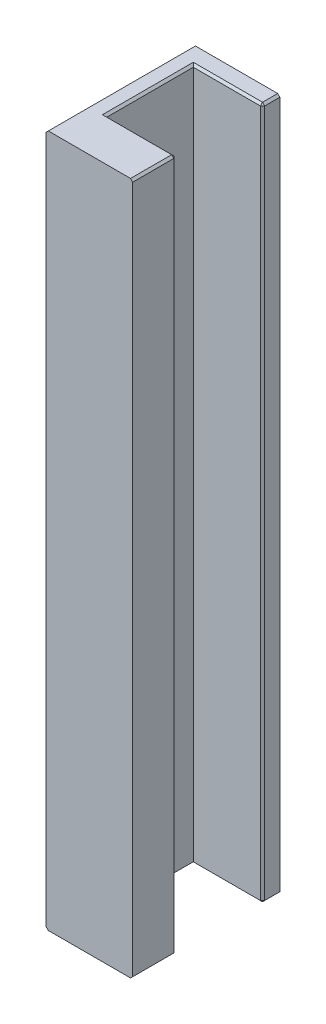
from build123d import *

# Parameters (mm, degrees)
SKETCH1_W           = 2
SKETCH1_H           = 10
BOSS_EXTRUDE1_DEPTH = 80
CHAMFER1_SIZE       = 0.25


with BuildPart() as part:
    # Sketch1 → Boss-Extrude1 (new body)
    with BuildSketch(Plane(origin=(0, 0, 0), x_dir=(1, 0, 0), z_dir=(0, 1, 0))):
        Polygon((1, -5), (-1, -5), (-1, -10), (9, -10), (9, -5), align=None)
        Rectangle(SKETCH1_W, SKETCH1_H)
        Polygon((-1, 7), (-1, 5), (1, 5), (9, 5), (9, 7), align=None)
    extrude(amount=BOSS_EXTRUDE1_DEPTH)

    # Chamfer1
    chamfer1_edges = [part.edges().sort_by_distance(p)[0] for p in [
        (5, 80, 5),
        (-1, 0, 1.5),
        (9, 0, -6),
        (5, 0, -5),
        (1, 0, 0),
        (5, 0, 5),
        (9, 0, 7.5),
        (1, 80, 0),
        (9, 40, -5),
        (9, 40, 5),
        (5, 80, -5),
        (9, 80, -6),
        (-1, 80, 1.5),
        (9, 80, 7.5),
    ]]
    chamfer(chamfer1_edges, length=CHAMFER1_SIZE)


solid = part.part
